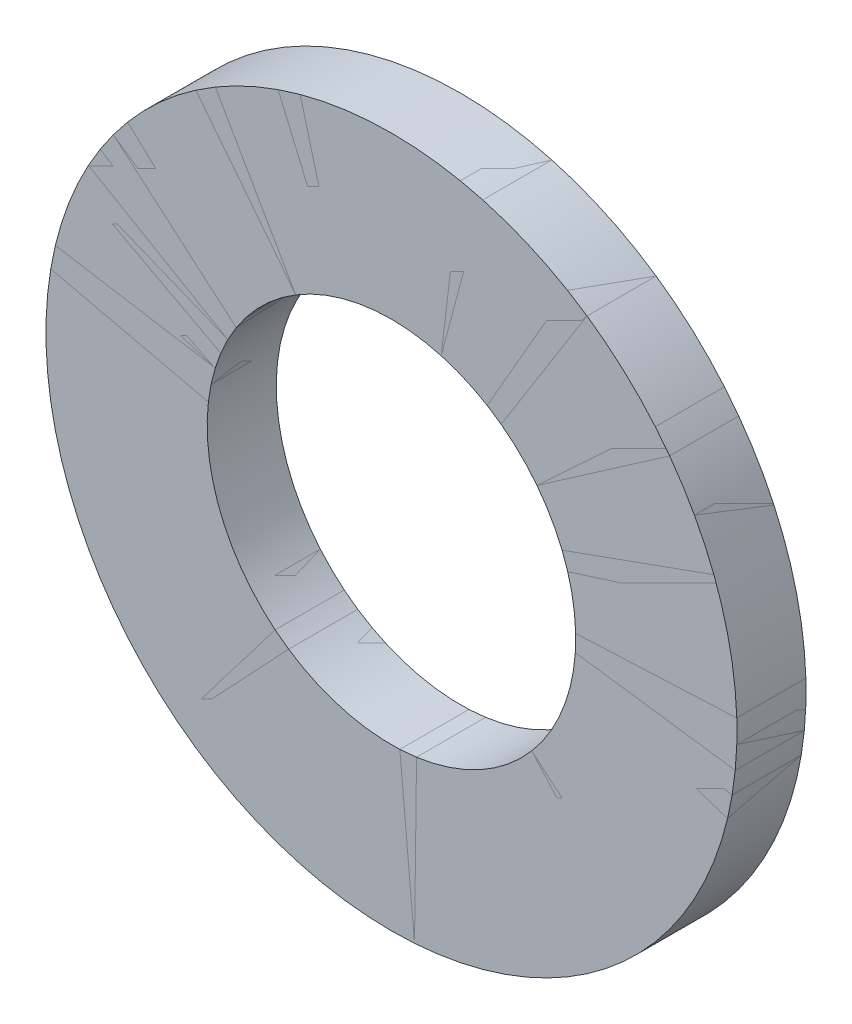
ISO-10303-21;
HEADER;
FILE_DESCRIPTION(('STEP AP214'),'2;1');
FILE_NAME('part.step','',(''),(''),'','','');
FILE_SCHEMA(('AUTOMOTIVE_DESIGN { 1 0 10303 214 1 1 1 1 }'));
ENDSEC;
DATA;
#1=APPLICATION_CONTEXT('core data for automotive mechanical design processes');
#2=APPLICATION_PROTOCOL_DEFINITION('international standard','automotive_design',2000,#1);
#3=PRODUCT_CONTEXT('',#1,'mechanical');
#4=PRODUCT('Part','Part','',(#3));
#5=PRODUCT_RELATED_PRODUCT_CATEGORY('part','',(#4));
#6=PRODUCT_DEFINITION_FORMATION('','',#4);
#7=PRODUCT_DEFINITION_CONTEXT('part definition',#1,'design');
#8=PRODUCT_DEFINITION('design','',#6,#7);
#9=PRODUCT_DEFINITION_SHAPE('','',#8);
#10=(LENGTH_UNIT() NAMED_UNIT(*) SI_UNIT(.MILLI.,.METRE.));
#11=(NAMED_UNIT(*) PLANE_ANGLE_UNIT() SI_UNIT($,.RADIAN.));
#12=(NAMED_UNIT(*) SI_UNIT($,.STERADIAN.) SOLID_ANGLE_UNIT());
#13=UNCERTAINTY_MEASURE_WITH_UNIT(LENGTH_MEASURE(1.E-05),#10,'distance_accuracy_value','');
#14=(GEOMETRIC_REPRESENTATION_CONTEXT(3) GLOBAL_UNCERTAINTY_ASSIGNED_CONTEXT((#13)) GLOBAL_UNIT_ASSIGNED_CONTEXT((#10,
#11,#12)) REPRESENTATION_CONTEXT('',''));
#15=CARTESIAN_POINT('',(0.,0.,0.));
#16=DIRECTION('',(0.,0.,1.));
#17=DIRECTION('',(1.,0.,0.));
#18=AXIS2_PLACEMENT_3D('',#15,#16,#17);
#19=CARTESIAN_POINT('',(0.,0.,0.));
#20=DIRECTION('',(0.,0.,-1.));
#21=DIRECTION('',(0.,1.,0.));
#22=AXIS2_PLACEMENT_3D('',#19,#20,#21);
#23=CYLINDRICAL_SURFACE('',#22,3.2);
#24=CARTESIAN_POINT('',(0.,0.,1.2));
#25=DIRECTION('',(0.,0.,-1.));
#26=DIRECTION('',(0.,1.,0.));
#27=AXIS2_PLACEMENT_3D('',#24,#25,#26);
#28=CIRCLE('',#27,3.2);
#29=CARTESIAN_POINT('',(0.,3.2,1.2));
#30=VERTEX_POINT('',#29);
#31=EDGE_CURVE('P0_E10',#30,#30,#28,.T.);
#32=ORIENTED_EDGE('',*,*,#31,.F.);
#33=EDGE_LOOP('',(#32));
#34=FACE_BOUND('',#33,.T.);
#35=CARTESIAN_POINT('',(0.,0.,0.));
#36=DIRECTION('',(0.,0.,-1.));
#37=DIRECTION('',(0.,1.,0.));
#38=AXIS2_PLACEMENT_3D('',#35,#36,#37);
#39=CIRCLE('',#38,3.2);
#40=CARTESIAN_POINT('',(0.,3.2,0.));
#41=VERTEX_POINT('',#40);
#42=EDGE_CURVE('P0_E38',#41,#41,#39,.T.);
#43=ORIENTED_EDGE('',*,*,#42,.T.);
#44=EDGE_LOOP('',(#43));
#45=FACE_BOUND('',#44,.T.);
#46=ADVANCED_FACE('P0_F24',(#34,#45),#23,.F.);
#47=CARTESIAN_POINT('',(6.,0.,1.2));
#48=DIRECTION('',(0.,0.,1.));
#49=DIRECTION('',(0.,-1.,0.));
#50=AXIS2_PLACEMENT_3D('',#47,#48,#49);
#51=PLANE('',#50);
#52=ORIENTED_EDGE('',*,*,#31,.T.);
#53=EDGE_LOOP('',(#52));
#54=FACE_BOUND('',#53,.T.);
#55=CARTESIAN_POINT('',(0.,0.,1.2));
#56=DIRECTION('',(0.,0.,-1.));
#57=DIRECTION('',(0.,1.,0.));
#58=AXIS2_PLACEMENT_3D('',#55,#56,#57);
#59=CIRCLE('',#58,6.);
#60=CARTESIAN_POINT('',(0.,6.,1.2));
#61=VERTEX_POINT('',#60);
#62=EDGE_CURVE('P0_E30',#61,#61,#59,.T.);
#63=ORIENTED_EDGE('',*,*,#62,.F.);
#64=EDGE_LOOP('',(#63));
#65=FACE_BOUND('',#64,.T.);
#66=ADVANCED_FACE('P0_F53',(#54,#65),#51,.T.);
#67=CARTESIAN_POINT('',(0.,0.,0.));
#68=DIRECTION('',(0.,0.,-1.));
#69=DIRECTION('',(0.,1.,0.));
#70=AXIS2_PLACEMENT_3D('',#67,#68,#69);
#71=CYLINDRICAL_SURFACE('',#70,6.);
#72=ORIENTED_EDGE('',*,*,#62,.T.);
#73=EDGE_LOOP('',(#72));
#74=FACE_BOUND('',#73,.T.);
#75=CARTESIAN_POINT('',(0.,0.,0.));
#76=DIRECTION('',(0.,0.,-1.));
#77=DIRECTION('',(0.,1.,0.));
#78=AXIS2_PLACEMENT_3D('',#75,#76,#77);
#79=CIRCLE('',#78,6.);
#80=CARTESIAN_POINT('',(0.,6.,0.));
#81=VERTEX_POINT('',#80);
#82=EDGE_CURVE('P0_E34',#81,#81,#79,.T.);
#83=ORIENTED_EDGE('',*,*,#82,.F.);
#84=EDGE_LOOP('',(#83));
#85=FACE_BOUND('',#84,.T.);
#86=ADVANCED_FACE('P0_F47',(#74,#85),#71,.T.);
#87=CARTESIAN_POINT('',(3.2,0.,0.));
#88=DIRECTION('',(0.,0.,-1.));
#89=DIRECTION('',(0.,1.,0.));
#90=AXIS2_PLACEMENT_3D('',#87,#88,#89);
#91=PLANE('',#90);
#92=ORIENTED_EDGE('',*,*,#82,.T.);
#93=EDGE_LOOP('',(#92));
#94=FACE_BOUND('',#93,.T.);
#95=ORIENTED_EDGE('',*,*,#42,.F.);
#96=EDGE_LOOP('',(#95));
#97=FACE_BOUND('',#96,.T.);
#98=ADVANCED_FACE('P0_F45',(#94,#97),#91,.T.);
#99=CLOSED_SHELL('',(#46,#66,#86,#98));
#100=MANIFOLD_SOLID_BREP('P0_B2',#99);
#101=CARTESIAN_POINT('',(0.,0.,0.));
#102=DIRECTION('',(0.,0.,-1.));
#103=DIRECTION('',(0.,1.,0.));
#104=AXIS2_PLACEMENT_3D('',#101,#102,#103);
#105=CYLINDRICAL_SURFACE('',#104,3.2);
#106=CARTESIAN_POINT('',(0.,0.,1.2));
#107=DIRECTION('',(0.,0.,-1.));
#108=DIRECTION('',(0.,1.,0.));
#109=AXIS2_PLACEMENT_3D('',#106,#107,#108);
#110=CIRCLE('',#109,3.2);
#111=CARTESIAN_POINT('',(0.,3.2,1.2));
#112=VERTEX_POINT('',#111);
#113=EDGE_CURVE('P1_E10',#112,#112,#110,.T.);
#114=ORIENTED_EDGE('',*,*,#113,.F.);
#115=EDGE_LOOP('',(#114));
#116=FACE_BOUND('',#115,.T.);
#117=CARTESIAN_POINT('',(0.,0.,0.));
#118=DIRECTION('',(0.,0.,-1.));
#119=DIRECTION('',(0.,1.,0.));
#120=AXIS2_PLACEMENT_3D('',#117,#118,#119);
#121=CIRCLE('',#120,3.2);
#122=CARTESIAN_POINT('',(0.,3.2,0.));
#123=VERTEX_POINT('',#122);
#124=EDGE_CURVE('P1_E28',#123,#123,#121,.T.);
#125=ORIENTED_EDGE('',*,*,#124,.T.);
#126=EDGE_LOOP('',(#125));
#127=FACE_BOUND('',#126,.T.);
#128=ADVANCED_FACE('P1_F14',(#116,#127),#105,.F.);
#129=CARTESIAN_POINT('',(6.,0.,1.2));
#130=DIRECTION('',(0.,0.,1.));
#131=DIRECTION('',(0.,-1.,0.));
#132=AXIS2_PLACEMENT_3D('',#129,#130,#131);
#133=PLANE('',#132);
#134=ORIENTED_EDGE('',*,*,#113,.T.);
#135=EDGE_LOOP('',(#134));
#136=FACE_BOUND('',#135,.T.);
#137=CARTESIAN_POINT('',(0.,0.,1.2));
#138=DIRECTION('',(0.,0.,-1.));
#139=DIRECTION('',(0.,1.,0.));
#140=AXIS2_PLACEMENT_3D('',#137,#138,#139);
#141=CIRCLE('',#140,6.);
#142=CARTESIAN_POINT('',(0.,6.,1.2));
#143=VERTEX_POINT('',#142);
#144=EDGE_CURVE('P1_E20',#143,#143,#141,.T.);
#145=ORIENTED_EDGE('',*,*,#144,.F.);
#146=EDGE_LOOP('',(#145));
#147=FACE_BOUND('',#146,.T.);
#148=ADVANCED_FACE('P1_F44',(#136,#147),#133,.T.);
#149=CARTESIAN_POINT('',(0.,0.,0.));
#150=DIRECTION('',(0.,0.,-1.));
#151=DIRECTION('',(0.,1.,0.));
#152=AXIS2_PLACEMENT_3D('',#149,#150,#151);
#153=CYLINDRICAL_SURFACE('',#152,6.);
#154=ORIENTED_EDGE('',*,*,#144,.T.);
#155=EDGE_LOOP('',(#154));
#156=FACE_BOUND('',#155,.T.);
#157=CARTESIAN_POINT('',(0.,0.,0.));
#158=DIRECTION('',(0.,0.,-1.));
#159=DIRECTION('',(0.,1.,0.));
#160=AXIS2_PLACEMENT_3D('',#157,#158,#159);
#161=CIRCLE('',#160,6.);
#162=CARTESIAN_POINT('',(0.,6.,0.));
#163=VERTEX_POINT('',#162);
#164=EDGE_CURVE('P1_E24',#163,#163,#161,.T.);
#165=ORIENTED_EDGE('',*,*,#164,.F.);
#166=EDGE_LOOP('',(#165));
#167=FACE_BOUND('',#166,.T.);
#168=ADVANCED_FACE('P1_F37',(#156,#167),#153,.T.);
#169=CARTESIAN_POINT('',(3.2,0.,0.));
#170=DIRECTION('',(0.,0.,-1.));
#171=DIRECTION('',(0.,1.,0.));
#172=AXIS2_PLACEMENT_3D('',#169,#170,#171);
#173=PLANE('',#172);
#174=ORIENTED_EDGE('',*,*,#164,.T.);
#175=EDGE_LOOP('',(#174));
#176=FACE_BOUND('',#175,.T.);
#177=ORIENTED_EDGE('',*,*,#124,.F.);
#178=EDGE_LOOP('',(#177));
#179=FACE_BOUND('',#178,.T.);
#180=ADVANCED_FACE('P1_F35',(#176,#179),#173,.T.);
#181=CLOSED_SHELL('',(#128,#148,#168,#180));
#182=MANIFOLD_SOLID_BREP('P1_B1',#181);
#183=ADVANCED_BREP_SHAPE_REPRESENTATION('',(#18,#100,#182),#14);
#184=SHAPE_DEFINITION_REPRESENTATION(#9,#183);
ENDSEC;
END-ISO-10303-21;
